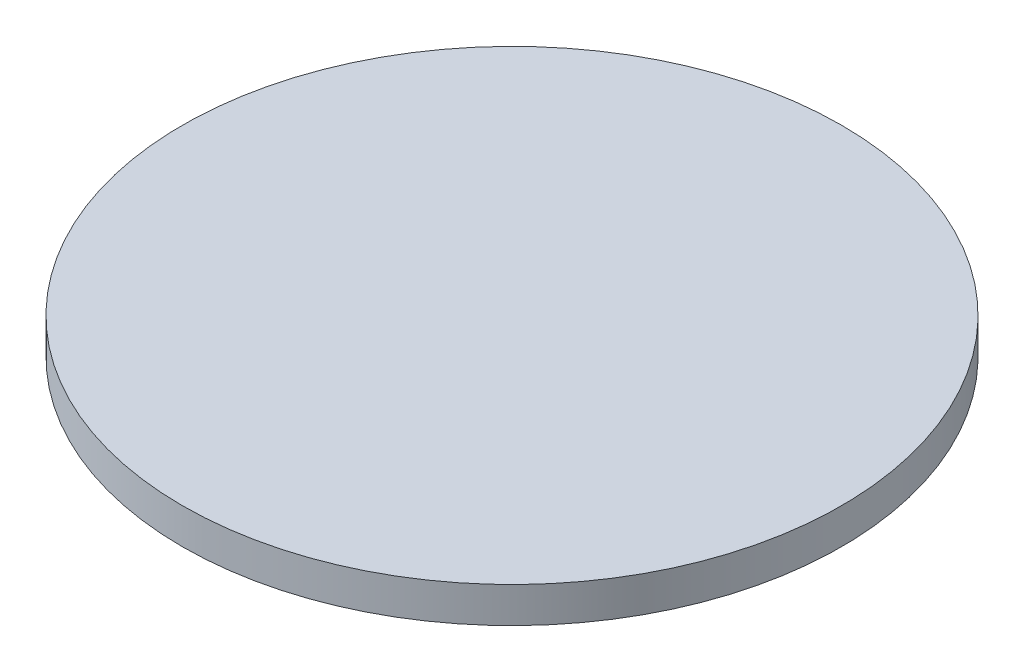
ISO-10303-21;
HEADER;
FILE_DESCRIPTION(('STEP AP214'),'2;1');
FILE_NAME('part.step','',(''),(''),'','','');
FILE_SCHEMA(('AUTOMOTIVE_DESIGN { 1 0 10303 214 1 1 1 1 }'));
ENDSEC;
DATA;
#1=APPLICATION_CONTEXT('core data for automotive mechanical design processes');
#2=APPLICATION_PROTOCOL_DEFINITION('international standard','automotive_design',2000,#1);
#3=PRODUCT_CONTEXT('',#1,'mechanical');
#4=PRODUCT('Part','Part','',(#3));
#5=PRODUCT_RELATED_PRODUCT_CATEGORY('part','',(#4));
#6=PRODUCT_DEFINITION_FORMATION('','',#4);
#7=PRODUCT_DEFINITION_CONTEXT('part definition',#1,'design');
#8=PRODUCT_DEFINITION('design','',#6,#7);
#9=PRODUCT_DEFINITION_SHAPE('','',#8);
#10=(LENGTH_UNIT() NAMED_UNIT(*) SI_UNIT(.MILLI.,.METRE.));
#11=(NAMED_UNIT(*) PLANE_ANGLE_UNIT() SI_UNIT($,.RADIAN.));
#12=(NAMED_UNIT(*) SI_UNIT($,.STERADIAN.) SOLID_ANGLE_UNIT());
#13=UNCERTAINTY_MEASURE_WITH_UNIT(LENGTH_MEASURE(1.E-05),#10,'distance_accuracy_value','');
#14=(GEOMETRIC_REPRESENTATION_CONTEXT(3) GLOBAL_UNCERTAINTY_ASSIGNED_CONTEXT((#13)) GLOBAL_UNIT_ASSIGNED_CONTEXT((#10,
#11,#12)) REPRESENTATION_CONTEXT('',''));
#15=CARTESIAN_POINT('',(0.,0.,0.));
#16=DIRECTION('',(0.,0.,1.));
#17=DIRECTION('',(1.,0.,0.));
#18=AXIS2_PLACEMENT_3D('',#15,#16,#17);
#19=CARTESIAN_POINT('',(0.,0.,0.));
#20=DIRECTION('',(0.,-1.,0.));
#21=DIRECTION('',(0.,0.,-1.));
#22=AXIS2_PLACEMENT_3D('',#19,#20,#21);
#23=CYLINDRICAL_SURFACE('',#22,25.);
#24=CARTESIAN_POINT('',(0.,46.6,0.));
#25=DIRECTION('',(0.,-1.,0.));
#26=DIRECTION('',(0.,0.,-1.));
#27=AXIS2_PLACEMENT_3D('',#24,#25,#26);
#28=CIRCLE('',#27,25.);
#29=CARTESIAN_POINT('',(0.,46.6,-25.));
#30=VERTEX_POINT('',#29);
#31=EDGE_CURVE('E38',#30,#30,#28,.T.);
#32=ORIENTED_EDGE('',*,*,#31,.T.);
#33=EDGE_LOOP('',(#32));
#34=FACE_BOUND('',#33,.T.);
#35=CARTESIAN_POINT('',(0.,43.9,0.));
#36=DIRECTION('',(0.,-1.,0.));
#37=DIRECTION('',(0.,0.,-1.));
#38=AXIS2_PLACEMENT_3D('',#35,#36,#37);
#39=CIRCLE('',#38,25.);
#40=CARTESIAN_POINT('',(0.,43.9,-25.));
#41=VERTEX_POINT('',#40);
#42=EDGE_CURVE('E10',#41,#41,#39,.T.);
#43=ORIENTED_EDGE('',*,*,#42,.F.);
#44=EDGE_LOOP('',(#43));
#45=FACE_BOUND('',#44,.T.);
#46=ADVANCED_FACE('F32',(#34,#45),#23,.T.);
#47=CARTESIAN_POINT('',(23.5,43.9,0.));
#48=DIRECTION('',(0.,-1.,0.));
#49=DIRECTION('',(0.,0.,-1.));
#50=AXIS2_PLACEMENT_3D('',#47,#48,#49);
#51=PLANE('',#50);
#52=ORIENTED_EDGE('',*,*,#42,.T.);
#53=EDGE_LOOP('',(#52));
#54=FACE_BOUND('',#53,.T.);
#55=ADVANCED_FACE('F48',(#54),#51,.T.);
#56=CARTESIAN_POINT('',(23.5,46.6,0.));
#57=DIRECTION('',(0.,1.,0.));
#58=DIRECTION('',(0.,0.,1.));
#59=AXIS2_PLACEMENT_3D('',#56,#57,#58);
#60=PLANE('',#59);
#61=ORIENTED_EDGE('',*,*,#31,.F.);
#62=EDGE_LOOP('',(#61));
#63=FACE_BOUND('',#62,.T.);
#64=ADVANCED_FACE('F46',(#63),#60,.T.);
#65=CLOSED_SHELL('',(#46,#55,#64));
#66=MANIFOLD_SOLID_BREP('B2',#65);
#67=ADVANCED_BREP_SHAPE_REPRESENTATION('',(#18,#66),#14);
#68=SHAPE_DEFINITION_REPRESENTATION(#9,#67);
ENDSEC;
END-ISO-10303-21;
